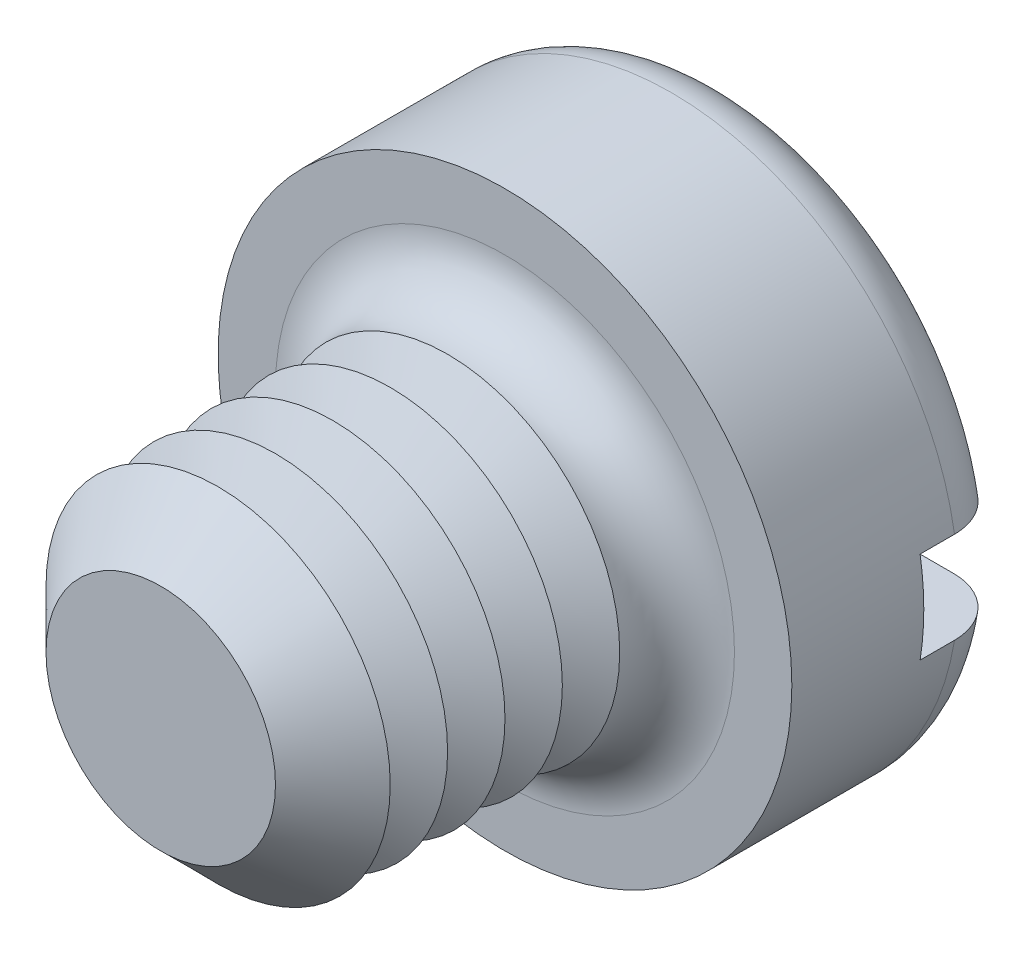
from build123d import *

# Parameters (mm, degrees)
SKETCH3_R           = 5
BOSS_EXTRUDE2_DEPTH = 3.9
SKETCH4_R           = 3
BOSS_EXTRUDE3_DEPTH = 6
FILLET1_R           = 1
CHAMFER1_SIZE       = 1
LPATTERN1_COUNT     = 4
LPATTERN1_PITCH     = 1
SKETCH8_W           = 10
SKETCH8_H           = 1.6
CUT_EXTRUDE1_DEPTH  = 1.6


with BuildPart() as part:
    # Sketch3 → Boss-Extrude2 (new body)
    with BuildSketch(Plane.XY):
        Circle(SKETCH3_R)
    extrude(amount=-BOSS_EXTRUDE2_DEPTH)

    # Sketch4 → Boss-Extrude3 (add)
    with BuildSketch(Plane.XY):
        Circle(SKETCH4_R)
    extrude(amount=BOSS_EXTRUDE3_DEPTH)

    # Fillet1
    fillet1_edges = [part.edges().sort_by_distance(p)[0] for p in [
        (-5, 0, -3.9),
        (-3, 0, 0),
    ]]
    fillet(fillet1_edges, radius=FILLET1_R)

    # Chamfer1
    chamfer1_edges = [part.edges().sort_by_distance(p)[0] for p in [
        (-3, 0, 6),
    ]]
    chamfer(chamfer1_edges, length=CHAMFER1_SIZE)

    # Sketch6 → Cut-Revolve1 (revolve, cut)
    with BuildSketch(Plane(origin=(0, 0, 0), x_dir=(0, 0, -1), z_dir=(1, 0, 0)), mode=Mode.PRIVATE) as cut_revolve1_sk:
        Polygon((-1, 3), (-1.5, 2.133974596), (-2, 3), align=None)
    cut_revolve1 = revolve(cut_revolve1_sk.sketch.rotate(Axis((0, 0, -1.694361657), (0, 0, 1)), 90), axis=Axis((0, 0, -1.694361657), (0, 0, 1)), mode=Mode.SUBTRACT)

    # LPattern1: Cut-Revolve1 ×4
    with Locations(*[(0, 0, i * LPATTERN1_PITCH) for i in range(1, LPATTERN1_COUNT)]):
        add(cut_revolve1, mode=Mode.SUBTRACT)

    # Sketch8 → Cut-Extrude1 (cut)
    with BuildSketch(Plane(origin=(0, 0, -3.9), x_dir=(-1, 0, 0), z_dir=(0, 0, -1))):
        Rectangle(SKETCH8_W, SKETCH8_H)
    extrude(amount=-CUT_EXTRUDE1_DEPTH, mode=Mode.SUBTRACT)


solid = part.part
